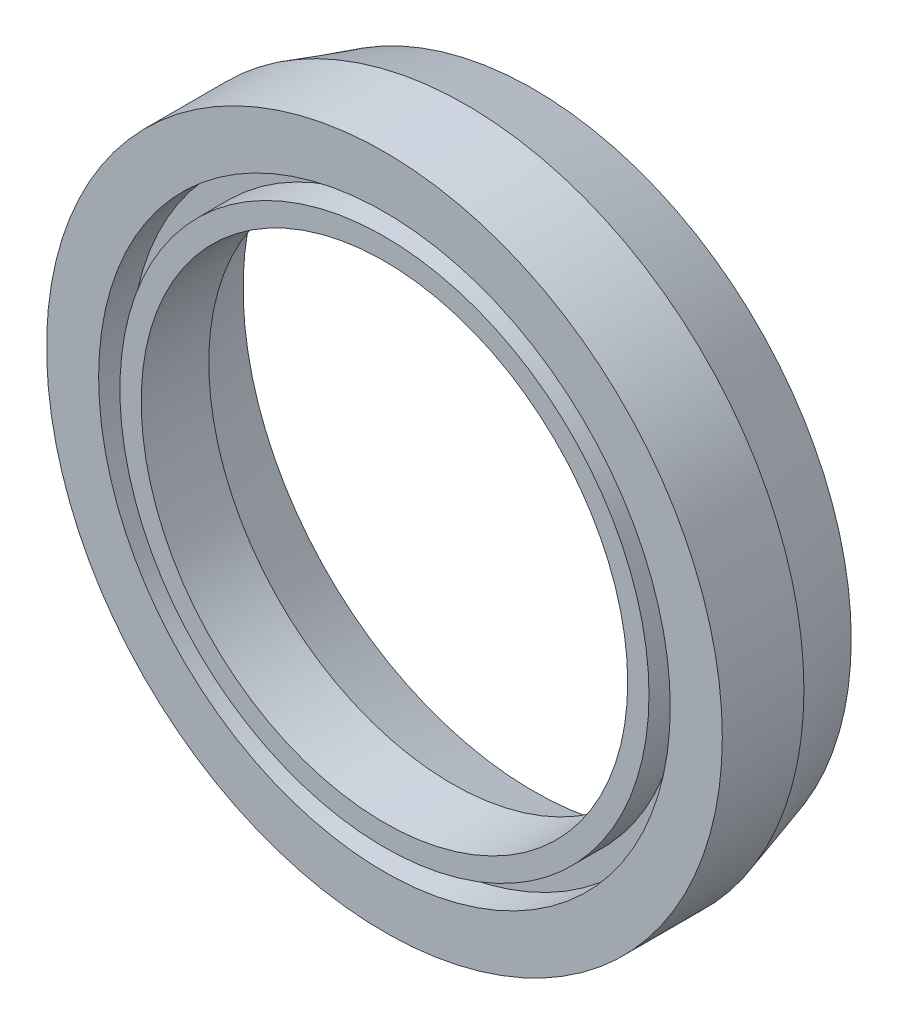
from build123d import *

# Parameters (mm, degrees)
SKETCH1_R           = 15.875
SKETCH1_R_2         = 11.43
BOSS_EXTRUDE1_DEPTH = 3.175
SKETCH3_R           = 13.43
SKETCH3_R_2         = 12.43
CUT_EXTRUDE1_DEPTH  = 1.5


with BuildPart() as part:
    # Sketch1 → Boss-Extrude1 (new body)
    with BuildSketch(Plane.XY):
        Circle(SKETCH1_R)
        Circle(SKETCH1_R_2, mode=Mode.SUBTRACT)
    extrude(amount=BOSS_EXTRUDE1_DEPTH)

    # Sketch2 → Revolve1 (revolve)
    with BuildSketch(Plane(origin=(0, 0, 0), x_dir=(1, 0, 0), z_dir=(0, 1, 0)), mode=Mode.PRIVATE) as revolve1_sk:
        Polygon((-14.9225, 3.8354), (-15.875, 0.6604), (-15.875, 0), (-12.7, 0), (-12.7, 0.6604), (-13.6525, 3.8354), (-13.6525, 0.0254), (-14.9225, 0.0254), align=None)
    revolve(revolve1_sk.sketch.rotate(Axis((0, 0, 3.175), (0, 0, -1)), 180), axis=Axis((0, 0, 3.175), (0, 0, -1)))

    # Sketch3 → Cut-Extrude1 (cut)
    with BuildSketch(Plane.XY.offset(3.175)):
        Circle(SKETCH3_R)
        Circle(SKETCH3_R_2, mode=Mode.SUBTRACT)
    extrude(amount=-CUT_EXTRUDE1_DEPTH, mode=Mode.SUBTRACT)


solid = part.part
